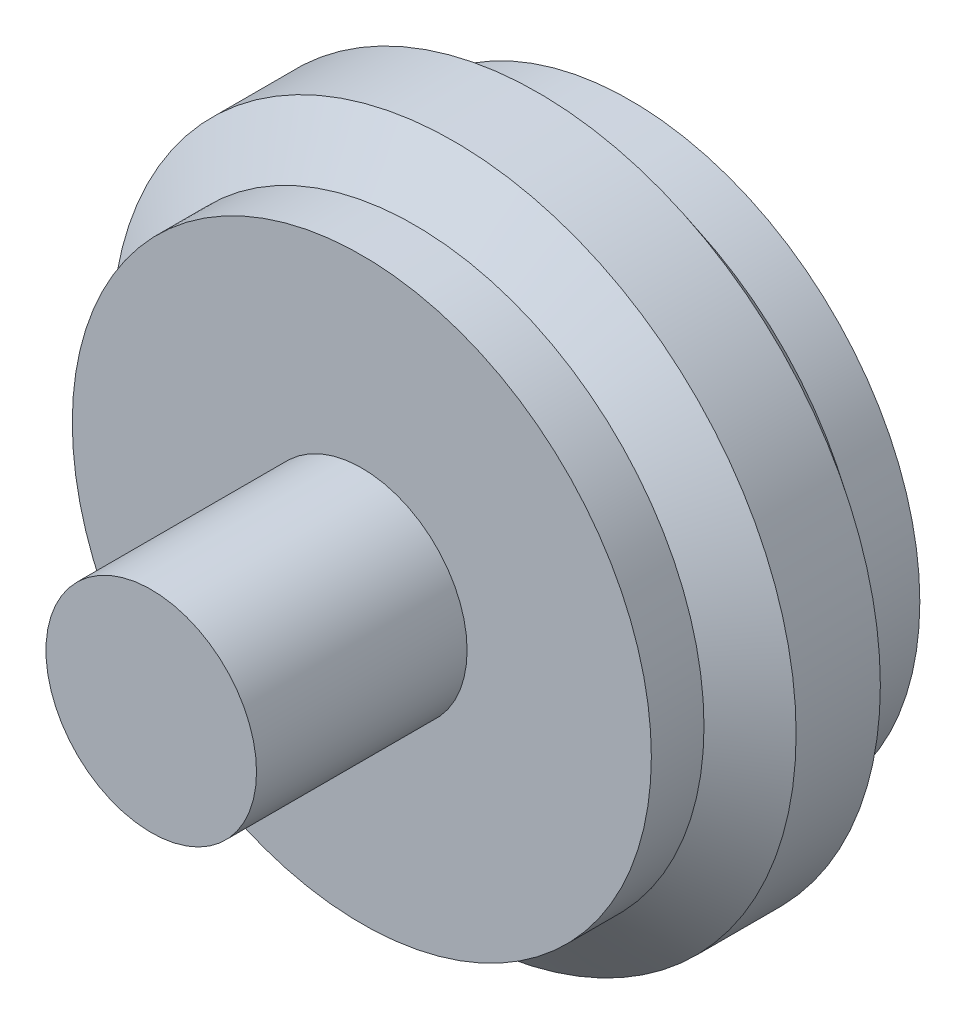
ISO-10303-21;
HEADER;
FILE_DESCRIPTION(('STEP AP214'),'2;1');
FILE_NAME('part.step','',(''),(''),'','','');
FILE_SCHEMA(('AUTOMOTIVE_DESIGN { 1 0 10303 214 1 1 1 1 }'));
ENDSEC;
DATA;
#1=APPLICATION_CONTEXT('core data for automotive mechanical design processes');
#2=APPLICATION_PROTOCOL_DEFINITION('international standard','automotive_design',2000,#1);
#3=PRODUCT_CONTEXT('',#1,'mechanical');
#4=PRODUCT('Part','Part','',(#3));
#5=PRODUCT_RELATED_PRODUCT_CATEGORY('part','',(#4));
#6=PRODUCT_DEFINITION_FORMATION('','',#4);
#7=PRODUCT_DEFINITION_CONTEXT('part definition',#1,'design');
#8=PRODUCT_DEFINITION('design','',#6,#7);
#9=PRODUCT_DEFINITION_SHAPE('','',#8);
#10=(LENGTH_UNIT() NAMED_UNIT(*) SI_UNIT(.MILLI.,.METRE.));
#11=(NAMED_UNIT(*) PLANE_ANGLE_UNIT() SI_UNIT($,.RADIAN.));
#12=(NAMED_UNIT(*) SI_UNIT($,.STERADIAN.) SOLID_ANGLE_UNIT());
#13=UNCERTAINTY_MEASURE_WITH_UNIT(LENGTH_MEASURE(1.E-05),#10,'distance_accuracy_value','');
#14=(GEOMETRIC_REPRESENTATION_CONTEXT(3) GLOBAL_UNCERTAINTY_ASSIGNED_CONTEXT((#13)) GLOBAL_UNIT_ASSIGNED_CONTEXT((#10,
#11,#12)) REPRESENTATION_CONTEXT('',''));
#15=CARTESIAN_POINT('',(0.,0.,0.));
#16=DIRECTION('',(0.,0.,1.));
#17=DIRECTION('',(1.,0.,0.));
#18=AXIS2_PLACEMENT_3D('',#15,#16,#17);
#19=CARTESIAN_POINT('',(0.,0.,-4.7));
#20=DIRECTION('',(0.,0.,1.));
#21=DIRECTION('',(1.,0.,0.));
#22=AXIS2_PLACEMENT_3D('',#19,#20,#21);
#23=CONICAL_SURFACE('',#22,13.,0.927295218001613);
#24=CARTESIAN_POINT('',(0.,0.,-6.2));
#25=DIRECTION('',(0.,0.,-1.));
#26=DIRECTION('',(-1.,0.,0.));
#27=AXIS2_PLACEMENT_3D('',#24,#25,#26);
#28=CIRCLE('',#27,11.);
#29=CARTESIAN_POINT('',(-11.,0.,-6.2));
#30=VERTEX_POINT('',#29);
#31=EDGE_CURVE('E60',#30,#30,#28,.T.);
#32=ORIENTED_EDGE('',*,*,#31,.F.);
#33=EDGE_LOOP('',(#32));
#34=FACE_BOUND('',#33,.T.);
#35=CARTESIAN_POINT('',(0.,0.,-4.7));
#36=DIRECTION('',(0.,0.,1.));
#37=DIRECTION('',(1.,0.,0.));
#38=AXIS2_PLACEMENT_3D('',#35,#36,#37);
#39=CIRCLE('',#38,13.);
#40=CARTESIAN_POINT('',(13.,0.,-4.7));
#41=VERTEX_POINT('',#40);
#42=EDGE_CURVE('E10',#41,#41,#39,.T.);
#43=ORIENTED_EDGE('',*,*,#42,.F.);
#44=EDGE_LOOP('',(#43));
#45=FACE_BOUND('',#44,.T.);
#46=ADVANCED_FACE('F37',(#34,#45),#23,.T.);
#47=CARTESIAN_POINT('',(0.,0.,0.));
#48=DIRECTION('',(0.,0.,1.));
#49=DIRECTION('',(1.,0.,0.));
#50=AXIS2_PLACEMENT_3D('',#47,#48,#49);
#51=CYLINDRICAL_SURFACE('',#50,13.);
#52=ORIENTED_EDGE('',*,*,#42,.T.);
#53=EDGE_LOOP('',(#52));
#54=FACE_BOUND('',#53,.T.);
#55=CARTESIAN_POINT('',(0.,0.,-1.5));
#56=DIRECTION('',(0.,0.,1.));
#57=DIRECTION('',(1.,0.,0.));
#58=AXIS2_PLACEMENT_3D('',#55,#56,#57);
#59=CIRCLE('',#58,13.);
#60=CARTESIAN_POINT('',(13.,0.,-1.5));
#61=VERTEX_POINT('',#60);
#62=EDGE_CURVE('E44',#61,#61,#59,.T.);
#63=ORIENTED_EDGE('',*,*,#62,.F.);
#64=EDGE_LOOP('',(#63));
#65=FACE_BOUND('',#64,.T.);
#66=ADVANCED_FACE('F77',(#54,#65),#51,.T.);
#67=CARTESIAN_POINT('',(0.,0.,0.));
#68=DIRECTION('',(0.,0.,-1.));
#69=DIRECTION('',(-1.,0.,0.));
#70=AXIS2_PLACEMENT_3D('',#67,#68,#69);
#71=CONICAL_SURFACE('',#70,11.,0.927295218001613);
#72=ORIENTED_EDGE('',*,*,#62,.T.);
#73=EDGE_LOOP('',(#72));
#74=FACE_BOUND('',#73,.T.);
#75=CARTESIAN_POINT('',(0.,0.,0.));
#76=DIRECTION('',(0.,0.,1.));
#77=DIRECTION('',(1.,0.,0.));
#78=AXIS2_PLACEMENT_3D('',#75,#76,#77);
#79=CIRCLE('',#78,11.);
#80=CARTESIAN_POINT('',(11.,0.,0.));
#81=VERTEX_POINT('',#80);
#82=EDGE_CURVE('E48',#81,#81,#79,.T.);
#83=ORIENTED_EDGE('',*,*,#82,.F.);
#84=EDGE_LOOP('',(#83));
#85=FACE_BOUND('',#84,.T.);
#86=ADVANCED_FACE('F81',(#74,#85),#71,.T.);
#87=CARTESIAN_POINT('',(0.,0.,2.));
#88=DIRECTION('',(0.,0.,-1.));
#89=DIRECTION('',(-1.,0.,0.));
#90=AXIS2_PLACEMENT_3D('',#87,#88,#89);
#91=CYLINDRICAL_SURFACE('',#90,11.);
#92=CARTESIAN_POINT('',(0.,0.,2.));
#93=DIRECTION('',(0.,0.,1.));
#94=DIRECTION('',(1.,0.,0.));
#95=AXIS2_PLACEMENT_3D('',#92,#93,#94);
#96=CIRCLE('',#95,11.);
#97=CARTESIAN_POINT('',(11.,0.,2.));
#98=VERTEX_POINT('',#97);
#99=EDGE_CURVE('E56',#98,#98,#96,.T.);
#100=ORIENTED_EDGE('',*,*,#99,.F.);
#101=EDGE_LOOP('',(#100));
#102=FACE_BOUND('',#101,.T.);
#103=ORIENTED_EDGE('',*,*,#82,.T.);
#104=EDGE_LOOP('',(#103));
#105=FACE_BOUND('',#104,.T.);
#106=ADVANCED_FACE('F85',(#102,#105),#91,.T.);
#107=CARTESIAN_POINT('',(0.,0.,2.));
#108=DIRECTION('',(0.,0.,1.));
#109=DIRECTION('',(1.,0.,0.));
#110=AXIS2_PLACEMENT_3D('',#107,#108,#109);
#111=PLANE('',#110);
#112=CARTESIAN_POINT('',(0.,0.,2.));
#113=DIRECTION('',(0.,0.,1.));
#114=DIRECTION('',(1.,0.,0.));
#115=AXIS2_PLACEMENT_3D('',#112,#113,#114);
#116=CIRCLE('',#115,4.);
#117=CARTESIAN_POINT('',(4.,0.,2.));
#118=VERTEX_POINT('',#117);
#119=EDGE_CURVE('E40',#118,#118,#116,.T.);
#120=ORIENTED_EDGE('',*,*,#119,.F.);
#121=EDGE_LOOP('',(#120));
#122=FACE_BOUND('',#121,.T.);
#123=ORIENTED_EDGE('',*,*,#99,.T.);
#124=EDGE_LOOP('',(#123));
#125=FACE_BOUND('',#124,.T.);
#126=ADVANCED_FACE('F96',(#122,#125),#111,.T.);
#127=CARTESIAN_POINT('',(0.,0.,10.));
#128=DIRECTION('',(0.,0.,1.));
#129=DIRECTION('',(1.,0.,0.));
#130=AXIS2_PLACEMENT_3D('',#127,#128,#129);
#131=PLANE('',#130);
#132=CARTESIAN_POINT('',(0.,0.,10.));
#133=DIRECTION('',(0.,0.,1.));
#134=DIRECTION('',(1.,0.,0.));
#135=AXIS2_PLACEMENT_3D('',#132,#133,#134);
#136=CIRCLE('',#135,4.);
#137=CARTESIAN_POINT('',(4.,0.,10.));
#138=VERTEX_POINT('',#137);
#139=EDGE_CURVE('E53',#138,#138,#136,.T.);
#140=ORIENTED_EDGE('',*,*,#139,.T.);
#141=EDGE_LOOP('',(#140));
#142=FACE_BOUND('',#141,.T.);
#143=ADVANCED_FACE('F92',(#142),#131,.T.);
#144=CARTESIAN_POINT('',(0.,0.,10.));
#145=DIRECTION('',(0.,0.,-1.));
#146=DIRECTION('',(-1.,0.,0.));
#147=AXIS2_PLACEMENT_3D('',#144,#145,#146);
#148=CYLINDRICAL_SURFACE('',#147,4.);
#149=ORIENTED_EDGE('',*,*,#119,.T.);
#150=EDGE_LOOP('',(#149));
#151=FACE_BOUND('',#150,.T.);
#152=ORIENTED_EDGE('',*,*,#139,.F.);
#153=EDGE_LOOP('',(#152));
#154=FACE_BOUND('',#153,.T.);
#155=ADVANCED_FACE('F71',(#151,#154),#148,.T.);
#156=CARTESIAN_POINT('',(0.,0.,-8.2));
#157=DIRECTION('',(0.,0.,1.));
#158=DIRECTION('',(1.,0.,0.));
#159=AXIS2_PLACEMENT_3D('',#156,#157,#158);
#160=CYLINDRICAL_SURFACE('',#159,11.);
#161=CARTESIAN_POINT('',(0.,0.,-8.2));
#162=DIRECTION('',(0.,0.,-1.));
#163=DIRECTION('',(-1.,0.,0.));
#164=AXIS2_PLACEMENT_3D('',#161,#162,#163);
#165=CIRCLE('',#164,11.);
#166=CARTESIAN_POINT('',(-11.,0.,-8.2));
#167=VERTEX_POINT('',#166);
#168=EDGE_CURVE('E59',#167,#167,#165,.T.);
#169=ORIENTED_EDGE('',*,*,#168,.F.);
#170=EDGE_LOOP('',(#169));
#171=FACE_BOUND('',#170,.T.);
#172=ORIENTED_EDGE('',*,*,#31,.T.);
#173=EDGE_LOOP('',(#172));
#174=FACE_BOUND('',#173,.T.);
#175=ADVANCED_FACE('F68',(#171,#174),#160,.T.);
#176=CARTESIAN_POINT('',(0.,0.,-8.2));
#177=DIRECTION('',(0.,0.,-1.));
#178=DIRECTION('',(-1.,0.,0.));
#179=AXIS2_PLACEMENT_3D('',#176,#177,#178);
#180=PLANE('',#179);
#181=ORIENTED_EDGE('',*,*,#168,.T.);
#182=EDGE_LOOP('',(#181));
#183=FACE_BOUND('',#182,.T.);
#184=ADVANCED_FACE('F66',(#183),#180,.T.);
#185=CLOSED_SHELL('',(#46,#66,#86,#106,#126,#143,#155,#175,#184));
#186=MANIFOLD_SOLID_BREP('B2',#185);
#187=ADVANCED_BREP_SHAPE_REPRESENTATION('',(#18,#186),#14);
#188=SHAPE_DEFINITION_REPRESENTATION(#9,#187);
ENDSEC;
END-ISO-10303-21;
